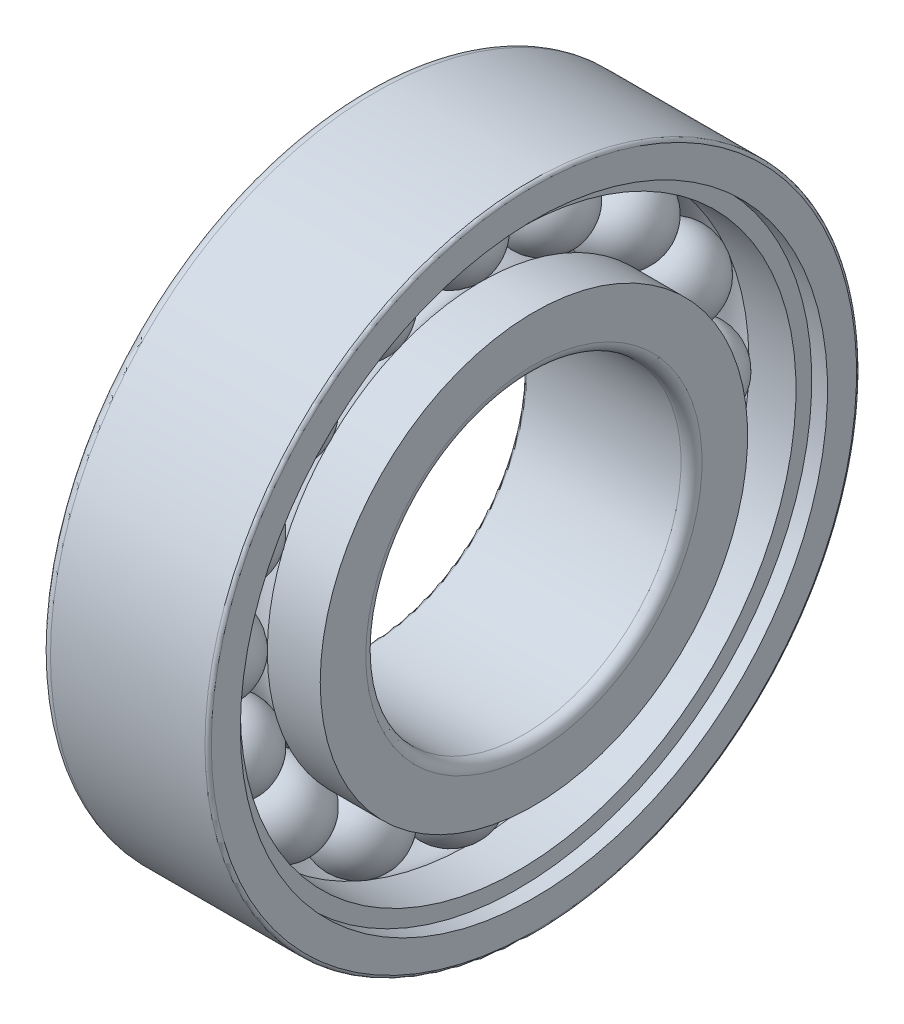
from build123d import *

# Parameters (mm, degrees)
CIRCULAR_PATTERN1_COUNT = 16
FILLET1_R               = 1
FILLET2_R               = 0.3


with BuildPart() as part:
    # Sketch1 → Revolve1 (revolve)
    with BuildSketch(Plane.XY):
        with BuildLine():
            Line((-4, 23), (4, 23))
            ThreePointArc((4, 23), (0, 19), (-4, 23))
        make_face()
    revolve1 = revolve(axis=Axis((-3.091912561, 23, 0), (1, 0, 0)))

    # Sketch2 → Revolve2 (revolve)
    with BuildSketch(Plane.XY, mode=Mode.PRIVATE) as revolve2_sk:
        with BuildLine():
            Line((-8, 20.333333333), (-2.967994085, 20.333333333))
            ThreePointArc((-2.967994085, 20.333333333), (0, 19.01), (2.967994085, 20.333333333))
            Line((2.967994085, 20.333333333), (8, 20.333333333))
            Line((8, 20.333333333), (8, 15))
            Line((8, 15), (-8, 15))
            Line((-8, 15), (-8, 20.333333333))
        make_face()
    revolve(revolve2_sk.sketch.rotate(Axis((-2.992358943, 0, 0), (1, 0, 0)), 90), axis=Axis((-2.992358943, 0, 0), (1, 0, 0)))

    # Sketch3 → Revolve3 (revolve)
    with BuildSketch(Plane.XY, mode=Mode.PRIVATE) as revolve3_sk:
        with BuildLine():
            Line((-8, 25.666666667), (-8, 31))
            Line((-8, 31), (8, 31))
            Line((8, 31), (8, 27.936666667))
            Line((8, 27.936666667), (6.5, 27.936666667))
            Line((6.5, 27.936666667), (6.5, 26.436666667))
            Line((6.5, 26.436666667), (2.02717099, 26.436666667))
            ThreePointArc((2.02717099, 26.436666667), (-0.607875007, 26.943423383), (-2.967994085, 25.666666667))
            Line((-2.967994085, 25.666666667), (-8, 25.666666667))
        make_face()
    revolve(revolve3_sk.sketch.rotate(Axis((-2.992358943, 0, 0), (1, 0, 0)), 90), axis=Axis((-2.992358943, 0, 0), (1, 0, 0)))

    # Circular-Pattern1: Revolve1 ×16 about axis
    circular_pattern1_axis = Axis((0, 0, 0), (1, 0, 0))
    for i in range(1, CIRCULAR_PATTERN1_COUNT):
        add(revolve1.rotate(circular_pattern1_axis, i * 360 / CIRCULAR_PATTERN1_COUNT))

    # Fillet1
    fillet1_edges = [part.edges().sort_by_distance(p)[0] for p in [
        (-8, 0, -31),
        (8, 0, -15),
    ]]
    fillet(fillet1_edges, radius=FILLET1_R)

    # Fillet2
    fillet2_edges = [part.edges().sort_by_distance(p)[0] for p in [
        (8, 0, -31),
        (-8, 0, -15),
    ]]
    fillet(fillet2_edges, radius=FILLET2_R)


solid = part.part
